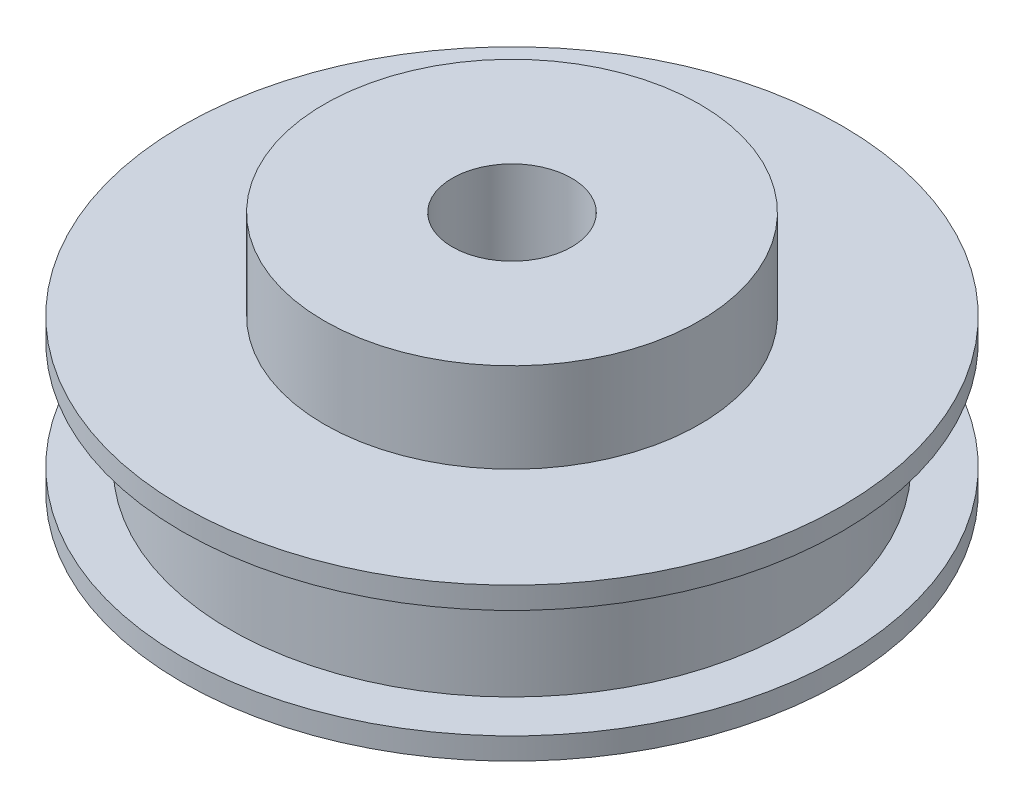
from build123d import *

# Parameters (mm, degrees)
SKETCH1_R           = 21.971
BOSS_EXTRUDE1_DEPTH = 10.16
SKETCH2_W           = 3.175
SKETCH2_H           = 7.239
SKETCH3_R           = 12.5095
BOSS_EXTRUDE2_DEPTH = 5.969
SKETCH4_R           = 3.9751
CUT_EXTRUDE1_DEPTH  = 36.008489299


with BuildPart() as part:
    # Sketch1 → Boss-Extrude1 (new body)
    with BuildSketch(Plane(origin=(0, 0, 0), x_dir=(1, 0, 0), z_dir=(0, 1, 0))):
        with Locations(Location((0, 0, 0), (0, 0, 270))):
            Circle(SKETCH1_R)
    extrude(amount=BOSS_EXTRUDE1_DEPTH)

    # Sketch2 → Cut-Revolve1 (revolve, cut)
    with BuildSketch(Plane.XY, mode=Mode.PRIVATE) as cut_revolve1_sk:
        with Locations((-20.3835, 5.08)):
            Rectangle(SKETCH2_W, SKETCH2_H)
    revolve(cut_revolve1_sk.sketch.rotate(Axis((0, 0, 0), (0, 1, 0)), 270), axis=Axis((0, 0, 0), (0, 1, 0)), mode=Mode.SUBTRACT)

    # Sketch3 → Boss-Extrude2 (add)
    with BuildSketch(Plane(origin=(0, 10.16, 0), x_dir=(1, 0, 0), z_dir=(0, 1, 0))):
        with Locations(Location((0, 0, 0), (0, 0, 270))):
            Circle(SKETCH3_R)
    extrude(amount=BOSS_EXTRUDE2_DEPTH)

    # Sketch4 → Cut-Extrude1 (cut, through all)
    with BuildSketch(Plane(origin=(0, 16.129, 0), x_dir=(1, 0, 0), z_dir=(0, 1, 0))):
        with Locations(Location((0, 0, 0), (0, 0, 270))):
            Circle(SKETCH4_R)
    extrude(amount=-CUT_EXTRUDE1_DEPTH, mode=Mode.SUBTRACT)


solid = part.part
